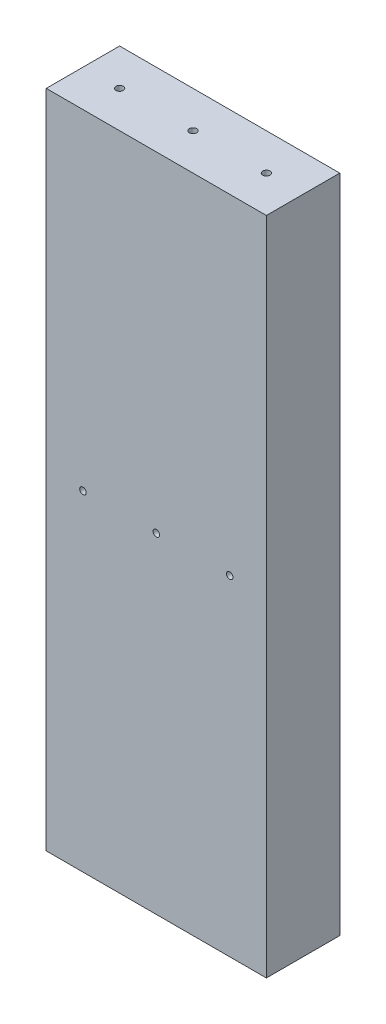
ISO-10303-21;
HEADER;
FILE_DESCRIPTION(('STEP AP214'),'2;1');
FILE_NAME('part.step','',(''),(''),'','','');
FILE_SCHEMA(('AUTOMOTIVE_DESIGN { 1 0 10303 214 1 1 1 1 }'));
ENDSEC;
DATA;
#1=APPLICATION_CONTEXT('core data for automotive mechanical design processes');
#2=APPLICATION_PROTOCOL_DEFINITION('international standard','automotive_design',2000,#1);
#3=PRODUCT_CONTEXT('',#1,'mechanical');
#4=PRODUCT('Part','Part','',(#3));
#5=PRODUCT_RELATED_PRODUCT_CATEGORY('part','',(#4));
#6=PRODUCT_DEFINITION_FORMATION('','',#4);
#7=PRODUCT_DEFINITION_CONTEXT('part definition',#1,'design');
#8=PRODUCT_DEFINITION('design','',#6,#7);
#9=PRODUCT_DEFINITION_SHAPE('','',#8);
#10=(LENGTH_UNIT() NAMED_UNIT(*) SI_UNIT(.MILLI.,.METRE.));
#11=(NAMED_UNIT(*) PLANE_ANGLE_UNIT() SI_UNIT($,.RADIAN.));
#12=(NAMED_UNIT(*) SI_UNIT($,.STERADIAN.) SOLID_ANGLE_UNIT());
#13=UNCERTAINTY_MEASURE_WITH_UNIT(LENGTH_MEASURE(1.E-05),#10,'distance_accuracy_value','');
#14=(GEOMETRIC_REPRESENTATION_CONTEXT(3) GLOBAL_UNCERTAINTY_ASSIGNED_CONTEXT((#13)) GLOBAL_UNIT_ASSIGNED_CONTEXT((#10,
#11,#12)) REPRESENTATION_CONTEXT('',''));
#15=CARTESIAN_POINT('',(0.,0.,0.));
#16=DIRECTION('',(0.,0.,1.));
#17=DIRECTION('',(1.,0.,0.));
#18=AXIS2_PLACEMENT_3D('',#15,#16,#17);
#19=CARTESIAN_POINT('',(76.2,457.2,-25.4));
#20=DIRECTION('',(-1.,0.,0.));
#21=DIRECTION('',(0.,0.,1.));
#22=AXIS2_PLACEMENT_3D('',#19,#20,#21);
#23=PLANE('',#22);
#24=DIRECTION('',(0.,0.,-1.));
#25=VECTOR('',#24,1.);
#26=CARTESIAN_POINT('',(76.2,0.,-25.4));
#27=LINE('',#26,#25);
#28=CARTESIAN_POINT('',(76.2,0.,25.4));
#29=VERTEX_POINT('',#28);
#30=CARTESIAN_POINT('',(76.2,0.,-25.4));
#31=VERTEX_POINT('',#30);
#32=EDGE_CURVE('E170',#29,#31,#27,.T.);
#33=ORIENTED_EDGE('',*,*,#32,.T.);
#34=DIRECTION('',(0.,-1.,0.));
#35=VECTOR('',#34,1.);
#36=CARTESIAN_POINT('',(76.2,457.2,-25.4));
#37=LINE('',#36,#35);
#38=CARTESIAN_POINT('',(76.2,457.2,-25.4));
#39=VERTEX_POINT('',#38);
#40=EDGE_CURVE('E11',#39,#31,#37,.T.);
#41=ORIENTED_EDGE('',*,*,#40,.F.);
#42=DIRECTION('',(0.,0.,-1.));
#43=VECTOR('',#42,1.);
#44=CARTESIAN_POINT('',(76.2,457.2,-25.4));
#45=LINE('',#44,#43);
#46=CARTESIAN_POINT('',(76.2,457.2,25.4));
#47=VERTEX_POINT('',#46);
#48=EDGE_CURVE('E171',#47,#39,#45,.T.);
#49=ORIENTED_EDGE('',*,*,#48,.F.);
#50=DIRECTION('',(0.,-1.,0.));
#51=VECTOR('',#50,1.);
#52=CARTESIAN_POINT('',(76.2,457.2,25.4));
#53=LINE('',#52,#51);
#54=EDGE_CURVE('E177',#47,#29,#53,.T.);
#55=ORIENTED_EDGE('',*,*,#54,.T.);
#56=EDGE_LOOP('',(#33,#41,#49,#55));
#57=FACE_BOUND('',#56,.T.);
#58=ADVANCED_FACE('F32',(#57),#23,.F.);
#59=CARTESIAN_POINT('',(-76.2,457.2,-25.4));
#60=DIRECTION('',(0.,0.,1.));
#61=DIRECTION('',(1.,0.,0.));
#62=AXIS2_PLACEMENT_3D('',#59,#60,#61);
#63=PLANE('',#62);
#64=CARTESIAN_POINT('',(-50.8,228.6,-25.4));
#65=DIRECTION('',(0.,0.,-1.));
#66=DIRECTION('',(-1.,0.,0.));
#67=AXIS2_PLACEMENT_3D('',#64,#65,#66);
#68=CIRCLE('',#67,4.2164);
#69=CARTESIAN_POINT('',(-55.0164,228.6,-25.4));
#70=VERTEX_POINT('',#69);
#71=EDGE_CURVE('E143',#70,#70,#68,.T.);
#72=ORIENTED_EDGE('',*,*,#71,.F.);
#73=EDGE_LOOP('',(#72));
#74=FACE_BOUND('',#73,.T.);
#75=CARTESIAN_POINT('',(0.,228.6,-25.4));
#76=DIRECTION('',(0.,0.,-1.));
#77=DIRECTION('',(-1.,0.,0.));
#78=AXIS2_PLACEMENT_3D('',#75,#76,#77);
#79=CIRCLE('',#78,4.2164);
#80=CARTESIAN_POINT('',(-4.2164,228.6,-25.4));
#81=VERTEX_POINT('',#80);
#82=EDGE_CURVE('E152',#81,#81,#79,.T.);
#83=ORIENTED_EDGE('',*,*,#82,.F.);
#84=EDGE_LOOP('',(#83));
#85=FACE_BOUND('',#84,.T.);
#86=CARTESIAN_POINT('',(50.8,228.6,-25.4));
#87=DIRECTION('',(0.,0.,-1.));
#88=DIRECTION('',(-1.,0.,0.));
#89=AXIS2_PLACEMENT_3D('',#86,#87,#88);
#90=CIRCLE('',#89,4.2164);
#91=CARTESIAN_POINT('',(46.5836,228.6,-25.4));
#92=VERTEX_POINT('',#91);
#93=EDGE_CURVE('E161',#92,#92,#90,.T.);
#94=ORIENTED_EDGE('',*,*,#93,.F.);
#95=EDGE_LOOP('',(#94));
#96=FACE_BOUND('',#95,.T.);
#97=DIRECTION('',(-1.,0.,0.));
#98=VECTOR('',#97,1.);
#99=CARTESIAN_POINT('',(-76.2,0.,-25.4));
#100=LINE('',#99,#98);
#101=CARTESIAN_POINT('',(-76.2,0.,-25.4));
#102=VERTEX_POINT('',#101);
#103=EDGE_CURVE('E180',#31,#102,#100,.T.);
#104=ORIENTED_EDGE('',*,*,#103,.T.);
#105=DIRECTION('',(0.,-1.,0.));
#106=VECTOR('',#105,1.);
#107=CARTESIAN_POINT('',(-76.2,457.2,-25.4));
#108=LINE('',#107,#106);
#109=CARTESIAN_POINT('',(-76.2,457.2,-25.4));
#110=VERTEX_POINT('',#109);
#111=EDGE_CURVE('E40',#110,#102,#108,.T.);
#112=ORIENTED_EDGE('',*,*,#111,.F.);
#113=DIRECTION('',(-1.,0.,0.));
#114=VECTOR('',#113,1.);
#115=CARTESIAN_POINT('',(-76.2,457.2,-25.4));
#116=LINE('',#115,#114);
#117=EDGE_CURVE('E79',#39,#110,#116,.T.);
#118=ORIENTED_EDGE('',*,*,#117,.F.);
#119=ORIENTED_EDGE('',*,*,#40,.T.);
#120=EDGE_LOOP('',(#104,#112,#118,#119));
#121=FACE_BOUND('',#120,.T.);
#122=ADVANCED_FACE('F205',(#74,#85,#96,#121),#63,.F.);
#123=CARTESIAN_POINT('',(-76.2,457.2,-25.4));
#124=DIRECTION('',(1.,0.,0.));
#125=DIRECTION('',(0.,0.,-1.));
#126=AXIS2_PLACEMENT_3D('',#123,#124,#125);
#127=PLANE('',#126);
#128=DIRECTION('',(0.,0.,1.));
#129=VECTOR('',#128,1.);
#130=CARTESIAN_POINT('',(-76.2,0.,-25.4));
#131=LINE('',#130,#129);
#132=CARTESIAN_POINT('',(-76.2,0.,25.4));
#133=VERTEX_POINT('',#132);
#134=EDGE_CURVE('E66',#102,#133,#131,.T.);
#135=ORIENTED_EDGE('',*,*,#134,.T.);
#136=DIRECTION('',(0.,-1.,0.));
#137=VECTOR('',#136,1.);
#138=CARTESIAN_POINT('',(-76.2,457.2,25.4));
#139=LINE('',#138,#137);
#140=CARTESIAN_POINT('',(-76.2,457.2,25.4));
#141=VERTEX_POINT('',#140);
#142=EDGE_CURVE('E185',#141,#133,#139,.T.);
#143=ORIENTED_EDGE('',*,*,#142,.F.);
#144=DIRECTION('',(0.,0.,1.));
#145=VECTOR('',#144,1.);
#146=CARTESIAN_POINT('',(-76.2,457.2,-25.4));
#147=LINE('',#146,#145);
#148=EDGE_CURVE('E174',#110,#141,#147,.T.);
#149=ORIENTED_EDGE('',*,*,#148,.F.);
#150=ORIENTED_EDGE('',*,*,#111,.T.);
#151=EDGE_LOOP('',(#135,#143,#149,#150));
#152=FACE_BOUND('',#151,.T.);
#153=ADVANCED_FACE('F187',(#152),#127,.F.);
#154=CARTESIAN_POINT('',(-76.2,457.2,25.4));
#155=DIRECTION('',(0.,0.,-1.));
#156=DIRECTION('',(-1.,0.,0.));
#157=AXIS2_PLACEMENT_3D('',#154,#155,#156);
#158=PLANE('',#157);
#159=CARTESIAN_POINT('',(-50.8,228.6,25.4));
#160=DIRECTION('',(0.,0.,-1.));
#161=DIRECTION('',(-1.,0.,0.));
#162=AXIS2_PLACEMENT_3D('',#159,#160,#161);
#163=CIRCLE('',#162,2.24789999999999);
#164=CARTESIAN_POINT('',(-53.0479,228.6,25.4));
#165=VERTEX_POINT('',#164);
#166=EDGE_CURVE('E149',#165,#165,#163,.T.);
#167=ORIENTED_EDGE('',*,*,#166,.T.);
#168=EDGE_LOOP('',(#167));
#169=FACE_BOUND('',#168,.T.);
#170=CARTESIAN_POINT('',(0.,228.6,25.4));
#171=DIRECTION('',(0.,0.,-1.));
#172=DIRECTION('',(-1.,0.,0.));
#173=AXIS2_PLACEMENT_3D('',#170,#171,#172);
#174=CIRCLE('',#173,2.24789999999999);
#175=CARTESIAN_POINT('',(-2.24789999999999,228.6,25.4));
#176=VERTEX_POINT('',#175);
#177=EDGE_CURVE('E158',#176,#176,#174,.T.);
#178=ORIENTED_EDGE('',*,*,#177,.T.);
#179=EDGE_LOOP('',(#178));
#180=FACE_BOUND('',#179,.T.);
#181=CARTESIAN_POINT('',(50.8,228.6,25.4));
#182=DIRECTION('',(0.,0.,-1.));
#183=DIRECTION('',(-1.,0.,0.));
#184=AXIS2_PLACEMENT_3D('',#181,#182,#183);
#185=CIRCLE('',#184,2.24789999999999);
#186=CARTESIAN_POINT('',(48.5521,228.6,25.4));
#187=VERTEX_POINT('',#186);
#188=EDGE_CURVE('E167',#187,#187,#185,.T.);
#189=ORIENTED_EDGE('',*,*,#188,.T.);
#190=EDGE_LOOP('',(#189));
#191=FACE_BOUND('',#190,.T.);
#192=DIRECTION('',(1.,0.,0.));
#193=VECTOR('',#192,1.);
#194=CARTESIAN_POINT('',(-76.2,0.,25.4));
#195=LINE('',#194,#193);
#196=EDGE_CURVE('E72',#133,#29,#195,.T.);
#197=ORIENTED_EDGE('',*,*,#196,.T.);
#198=ORIENTED_EDGE('',*,*,#54,.F.);
#199=DIRECTION('',(1.,0.,0.));
#200=VECTOR('',#199,1.);
#201=CARTESIAN_POINT('',(-76.2,457.2,25.4));
#202=LINE('',#201,#200);
#203=EDGE_CURVE('E48',#141,#47,#202,.T.);
#204=ORIENTED_EDGE('',*,*,#203,.F.);
#205=ORIENTED_EDGE('',*,*,#142,.T.);
#206=EDGE_LOOP('',(#197,#198,#204,#205));
#207=FACE_BOUND('',#206,.T.);
#208=ADVANCED_FACE('F194',(#169,#180,#191,#207),#158,.F.);
#209=CARTESIAN_POINT('',(0.,457.2,0.));
#210=DIRECTION('',(0.,1.,0.));
#211=DIRECTION('',(0.,0.,1.));
#212=AXIS2_PLACEMENT_3D('',#209,#210,#211);
#213=PLANE('',#212);
#214=CARTESIAN_POINT('',(-50.8000000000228,457.2,8.21565038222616E-12));
#215=DIRECTION('',(0.,1.,0.));
#216=DIRECTION('',(0.,0.,1.));
#217=AXIS2_PLACEMENT_3D('',#214,#215,#216);
#218=CIRCLE('',#217,2.52729999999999);
#219=CARTESIAN_POINT('',(-50.8000000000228,457.2,2.5273000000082));
#220=VERTEX_POINT('',#219);
#221=EDGE_CURVE('E109',#220,#220,#218,.T.);
#222=ORIENTED_EDGE('',*,*,#221,.F.);
#223=EDGE_LOOP('',(#222));
#224=FACE_BOUND('',#223,.T.);
#225=CARTESIAN_POINT('',(0.,457.2,0.));
#226=DIRECTION('',(0.,1.,0.));
#227=DIRECTION('',(0.,0.,1.));
#228=AXIS2_PLACEMENT_3D('',#225,#226,#227);
#229=CIRCLE('',#228,2.52729999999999);
#230=CARTESIAN_POINT('',(0.,457.2,2.52729999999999));
#231=VERTEX_POINT('',#230);
#232=EDGE_CURVE('E108',#231,#231,#229,.T.);
#233=ORIENTED_EDGE('',*,*,#232,.F.);
#234=EDGE_LOOP('',(#233));
#235=FACE_BOUND('',#234,.T.);
#236=CARTESIAN_POINT('',(50.7999999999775,457.2,8.27116153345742E-12));
#237=DIRECTION('',(0.,1.,0.));
#238=DIRECTION('',(0.,0.,1.));
#239=AXIS2_PLACEMENT_3D('',#236,#237,#238);
#240=CIRCLE('',#239,2.52729999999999);
#241=CARTESIAN_POINT('',(50.7999999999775,457.2,2.52730000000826));
#242=VERTEX_POINT('',#241);
#243=EDGE_CURVE('E119',#242,#242,#240,.T.);
#244=ORIENTED_EDGE('',*,*,#243,.F.);
#245=EDGE_LOOP('',(#244));
#246=FACE_BOUND('',#245,.T.);
#247=ORIENTED_EDGE('',*,*,#48,.T.);
#248=ORIENTED_EDGE('',*,*,#117,.T.);
#249=ORIENTED_EDGE('',*,*,#148,.T.);
#250=ORIENTED_EDGE('',*,*,#203,.T.);
#251=EDGE_LOOP('',(#247,#248,#249,#250));
#252=FACE_BOUND('',#251,.T.);
#253=ADVANCED_FACE('F196',(#224,#235,#246,#252),#213,.T.);
#254=CARTESIAN_POINT('',(0.,0.,0.));
#255=DIRECTION('',(0.,1.,0.));
#256=DIRECTION('',(0.,0.,1.));
#257=AXIS2_PLACEMENT_3D('',#254,#255,#256);
#258=PLANE('',#257);
#259=CARTESIAN_POINT('',(50.7999999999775,0.,8.27116153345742E-12));
#260=DIRECTION('',(0.,-1.,0.));
#261=DIRECTION('',(0.,0.,-1.));
#262=AXIS2_PLACEMENT_3D('',#259,#260,#261);
#263=CIRCLE('',#262,2.52729999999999);
#264=CARTESIAN_POINT('',(50.7999999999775,0.,-2.52729999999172));
#265=VERTEX_POINT('',#264);
#266=EDGE_CURVE('E125',#265,#265,#263,.T.);
#267=ORIENTED_EDGE('',*,*,#266,.F.);
#268=EDGE_LOOP('',(#267));
#269=FACE_BOUND('',#268,.T.);
#270=CARTESIAN_POINT('',(0.,0.,0.));
#271=DIRECTION('',(0.,-1.,0.));
#272=DIRECTION('',(0.,0.,-1.));
#273=AXIS2_PLACEMENT_3D('',#270,#271,#272);
#274=CIRCLE('',#273,2.52729999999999);
#275=CARTESIAN_POINT('',(0.,0.,-2.52729999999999));
#276=VERTEX_POINT('',#275);
#277=EDGE_CURVE('E131',#276,#276,#274,.T.);
#278=ORIENTED_EDGE('',*,*,#277,.F.);
#279=EDGE_LOOP('',(#278));
#280=FACE_BOUND('',#279,.T.);
#281=CARTESIAN_POINT('',(-50.8000000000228,0.,8.21565038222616E-12));
#282=DIRECTION('',(0.,-1.,0.));
#283=DIRECTION('',(0.,0.,-1.));
#284=AXIS2_PLACEMENT_3D('',#281,#282,#283);
#285=CIRCLE('',#284,2.52729999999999);
#286=CARTESIAN_POINT('',(-50.8000000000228,0.,-2.52729999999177));
#287=VERTEX_POINT('',#286);
#288=EDGE_CURVE('E137',#287,#287,#285,.T.);
#289=ORIENTED_EDGE('',*,*,#288,.F.);
#290=EDGE_LOOP('',(#289));
#291=FACE_BOUND('',#290,.T.);
#292=ORIENTED_EDGE('',*,*,#32,.F.);
#293=ORIENTED_EDGE('',*,*,#196,.F.);
#294=ORIENTED_EDGE('',*,*,#134,.F.);
#295=ORIENTED_EDGE('',*,*,#103,.F.);
#296=EDGE_LOOP('',(#292,#293,#294,#295));
#297=FACE_BOUND('',#296,.T.);
#298=ADVANCED_FACE('F190',(#269,#280,#291,#297),#258,.F.);
#299=CARTESIAN_POINT('',(50.8,228.6,-25.4));
#300=DIRECTION('',(0.,0.,-1.));
#301=DIRECTION('',(-1.,0.,0.));
#302=AXIS2_PLACEMENT_3D('',#299,#300,#301);
#303=CYLINDRICAL_SURFACE('',#302,2.24789999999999);
#304=ORIENTED_EDGE('',*,*,#188,.F.);
#305=EDGE_LOOP('',(#304));
#306=FACE_BOUND('',#305,.T.);
#307=CARTESIAN_POINT('',(50.8,228.6,-23.7482323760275));
#308=DIRECTION('',(0.,0.,-1.));
#309=DIRECTION('',(-1.,0.,0.));
#310=AXIS2_PLACEMENT_3D('',#307,#308,#309);
#311=CIRCLE('',#310,2.24789999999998);
#312=CARTESIAN_POINT('',(48.5521,228.6,-23.7482323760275));
#313=VERTEX_POINT('',#312);
#314=EDGE_CURVE('E164',#313,#313,#311,.T.);
#315=ORIENTED_EDGE('',*,*,#314,.T.);
#316=EDGE_LOOP('',(#315));
#317=FACE_BOUND('',#316,.T.);
#318=ADVANCED_FACE('F225',(#306,#317),#303,.F.);
#319=CARTESIAN_POINT('',(50.8,228.6,-25.4));
#320=DIRECTION('',(0.,0.,-1.));
#321=DIRECTION('',(-1.,0.,0.));
#322=AXIS2_PLACEMENT_3D('',#319,#320,#321);
#323=CONICAL_SURFACE('',#322,4.2164,0.87266462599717);
#324=ORIENTED_EDGE('',*,*,#314,.F.);
#325=EDGE_LOOP('',(#324));
#326=FACE_BOUND('',#325,.T.);
#327=ORIENTED_EDGE('',*,*,#93,.T.);
#328=EDGE_LOOP('',(#327));
#329=FACE_BOUND('',#328,.T.);
#330=ADVANCED_FACE('F222',(#326,#329),#323,.F.);
#331=CARTESIAN_POINT('',(0.,228.6,-25.4));
#332=DIRECTION('',(0.,0.,-1.));
#333=DIRECTION('',(-1.,0.,0.));
#334=AXIS2_PLACEMENT_3D('',#331,#332,#333);
#335=CYLINDRICAL_SURFACE('',#334,2.24789999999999);
#336=ORIENTED_EDGE('',*,*,#177,.F.);
#337=EDGE_LOOP('',(#336));
#338=FACE_BOUND('',#337,.T.);
#339=CARTESIAN_POINT('',(0.,228.6,-23.7482323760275));
#340=DIRECTION('',(0.,0.,-1.));
#341=DIRECTION('',(-1.,0.,0.));
#342=AXIS2_PLACEMENT_3D('',#339,#340,#341);
#343=CIRCLE('',#342,2.24789999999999);
#344=CARTESIAN_POINT('',(-2.24789999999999,228.6,-23.7482323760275));
#345=VERTEX_POINT('',#344);
#346=EDGE_CURVE('E155',#345,#345,#343,.T.);
#347=ORIENTED_EDGE('',*,*,#346,.T.);
#348=EDGE_LOOP('',(#347));
#349=FACE_BOUND('',#348,.T.);
#350=ADVANCED_FACE('F224',(#338,#349),#335,.F.);
#351=CARTESIAN_POINT('',(0.,228.6,-25.4));
#352=DIRECTION('',(0.,0.,-1.));
#353=DIRECTION('',(-1.,0.,0.));
#354=AXIS2_PLACEMENT_3D('',#351,#352,#353);
#355=CONICAL_SURFACE('',#354,4.2164,0.872664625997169);
#356=ORIENTED_EDGE('',*,*,#346,.F.);
#357=EDGE_LOOP('',(#356));
#358=FACE_BOUND('',#357,.T.);
#359=ORIENTED_EDGE('',*,*,#82,.T.);
#360=EDGE_LOOP('',(#359));
#361=FACE_BOUND('',#360,.T.);
#362=ADVANCED_FACE('F232',(#358,#361),#355,.F.);
#363=CARTESIAN_POINT('',(-50.8,228.6,-25.4));
#364=DIRECTION('',(0.,0.,-1.));
#365=DIRECTION('',(-1.,0.,0.));
#366=AXIS2_PLACEMENT_3D('',#363,#364,#365);
#367=CYLINDRICAL_SURFACE('',#366,2.24789999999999);
#368=ORIENTED_EDGE('',*,*,#166,.F.);
#369=EDGE_LOOP('',(#368));
#370=FACE_BOUND('',#369,.T.);
#371=CARTESIAN_POINT('',(-50.8,228.6,-23.7482323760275));
#372=DIRECTION('',(0.,0.,-1.));
#373=DIRECTION('',(-1.,0.,0.));
#374=AXIS2_PLACEMENT_3D('',#371,#372,#373);
#375=CIRCLE('',#374,2.24789999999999);
#376=CARTESIAN_POINT('',(-53.0479,228.6,-23.7482323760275));
#377=VERTEX_POINT('',#376);
#378=EDGE_CURVE('E146',#377,#377,#375,.T.);
#379=ORIENTED_EDGE('',*,*,#378,.T.);
#380=EDGE_LOOP('',(#379));
#381=FACE_BOUND('',#380,.T.);
#382=ADVANCED_FACE('F270',(#370,#381),#367,.F.);
#383=CARTESIAN_POINT('',(-50.8,228.6,-25.4));
#384=DIRECTION('',(0.,0.,-1.));
#385=DIRECTION('',(-1.,0.,0.));
#386=AXIS2_PLACEMENT_3D('',#383,#384,#385);
#387=CONICAL_SURFACE('',#386,4.2164,0.872664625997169);
#388=ORIENTED_EDGE('',*,*,#378,.F.);
#389=EDGE_LOOP('',(#388));
#390=FACE_BOUND('',#389,.T.);
#391=ORIENTED_EDGE('',*,*,#71,.T.);
#392=EDGE_LOOP('',(#391));
#393=FACE_BOUND('',#392,.T.);
#394=ADVANCED_FACE('F262',(#390,#393),#387,.F.);
#395=CARTESIAN_POINT('',(-50.8000000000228,25.4,8.21565038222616E-12));
#396=DIRECTION('',(0.,-1.,0.));
#397=DIRECTION('',(0.,0.,-1.));
#398=AXIS2_PLACEMENT_3D('',#395,#396,#397);
#399=CONICAL_SURFACE('',#398,2.52729999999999,1.02974425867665);
#400=CARTESIAN_POINT('',(-50.8000000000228,26.9185550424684,8.21565038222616E-12));
#401=VERTEX_POINT('',#400);
#402=VERTEX_LOOP('',#401);
#403=FACE_BOUND('',#402,.T.);
#404=CARTESIAN_POINT('',(-50.8000000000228,25.4,8.21565038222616E-12));
#405=DIRECTION('',(0.,-1.,0.));
#406=DIRECTION('',(0.,0.,-1.));
#407=AXIS2_PLACEMENT_3D('',#404,#405,#406);
#408=CIRCLE('',#407,2.52729999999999);
#409=CARTESIAN_POINT('',(-50.8000000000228,25.4,-2.52729999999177));
#410=VERTEX_POINT('',#409);
#411=EDGE_CURVE('E140',#410,#410,#408,.T.);
#412=ORIENTED_EDGE('',*,*,#411,.T.);
#413=EDGE_LOOP('',(#412));
#414=FACE_BOUND('',#413,.T.);
#415=ADVANCED_FACE('F252',(#403,#414),#399,.F.);
#416=CARTESIAN_POINT('',(-50.8000000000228,0.,8.21565038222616E-12));
#417=DIRECTION('',(0.,-1.,0.));
#418=DIRECTION('',(0.,0.,-1.));
#419=AXIS2_PLACEMENT_3D('',#416,#417,#418);
#420=CYLINDRICAL_SURFACE('',#419,2.52729999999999);
#421=ORIENTED_EDGE('',*,*,#411,.F.);
#422=EDGE_LOOP('',(#421));
#423=FACE_BOUND('',#422,.T.);
#424=ORIENTED_EDGE('',*,*,#288,.T.);
#425=EDGE_LOOP('',(#424));
#426=FACE_BOUND('',#425,.T.);
#427=ADVANCED_FACE('F249',(#423,#426),#420,.F.);
#428=CARTESIAN_POINT('',(0.,25.4,0.));
#429=DIRECTION('',(0.,-1.,0.));
#430=DIRECTION('',(0.,0.,-1.));
#431=AXIS2_PLACEMENT_3D('',#428,#429,#430);
#432=CONICAL_SURFACE('',#431,2.52729999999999,1.02974425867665);
#433=CARTESIAN_POINT('',(0.,26.9185550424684,0.));
#434=VERTEX_POINT('',#433);
#435=VERTEX_LOOP('',#434);
#436=FACE_BOUND('',#435,.T.);
#437=CARTESIAN_POINT('',(0.,25.4,0.));
#438=DIRECTION('',(0.,-1.,0.));
#439=DIRECTION('',(0.,0.,-1.));
#440=AXIS2_PLACEMENT_3D('',#437,#438,#439);
#441=CIRCLE('',#440,2.52729999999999);
#442=CARTESIAN_POINT('',(0.,25.4,-2.52729999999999));
#443=VERTEX_POINT('',#442);
#444=EDGE_CURVE('E134',#443,#443,#441,.T.);
#445=ORIENTED_EDGE('',*,*,#444,.T.);
#446=EDGE_LOOP('',(#445));
#447=FACE_BOUND('',#446,.T.);
#448=ADVANCED_FACE('F251',(#436,#447),#432,.F.);
#449=CARTESIAN_POINT('',(0.,0.,0.));
#450=DIRECTION('',(0.,-1.,0.));
#451=DIRECTION('',(0.,0.,-1.));
#452=AXIS2_PLACEMENT_3D('',#449,#450,#451);
#453=CYLINDRICAL_SURFACE('',#452,2.52729999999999);
#454=ORIENTED_EDGE('',*,*,#444,.F.);
#455=EDGE_LOOP('',(#454));
#456=FACE_BOUND('',#455,.T.);
#457=ORIENTED_EDGE('',*,*,#277,.T.);
#458=EDGE_LOOP('',(#457));
#459=FACE_BOUND('',#458,.T.);
#460=ADVANCED_FACE('F259',(#456,#459),#453,.F.);
#461=CARTESIAN_POINT('',(50.7999999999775,25.4,8.27116153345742E-12));
#462=DIRECTION('',(0.,-1.,0.));
#463=DIRECTION('',(0.,0.,-1.));
#464=AXIS2_PLACEMENT_3D('',#461,#462,#463);
#465=CONICAL_SURFACE('',#464,2.52729999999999,1.02974425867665);
#466=CARTESIAN_POINT('',(50.7999999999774,26.9185550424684,8.27116153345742E-12));
#467=VERTEX_POINT('',#466);
#468=VERTEX_LOOP('',#467);
#469=FACE_BOUND('',#468,.T.);
#470=CARTESIAN_POINT('',(50.7999999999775,25.4,8.27116153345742E-12));
#471=DIRECTION('',(0.,-1.,0.));
#472=DIRECTION('',(0.,0.,-1.));
#473=AXIS2_PLACEMENT_3D('',#470,#471,#472);
#474=CIRCLE('',#473,2.52729999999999);
#475=CARTESIAN_POINT('',(50.7999999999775,25.4,-2.52729999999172));
#476=VERTEX_POINT('',#475);
#477=EDGE_CURVE('E128',#476,#476,#474,.T.);
#478=ORIENTED_EDGE('',*,*,#477,.T.);
#479=EDGE_LOOP('',(#478));
#480=FACE_BOUND('',#479,.T.);
#481=ADVANCED_FACE('F316',(#469,#480),#465,.F.);
#482=CARTESIAN_POINT('',(50.7999999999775,0.,8.27116153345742E-12));
#483=DIRECTION('',(0.,-1.,0.));
#484=DIRECTION('',(0.,0.,-1.));
#485=AXIS2_PLACEMENT_3D('',#482,#483,#484);
#486=CYLINDRICAL_SURFACE('',#485,2.52729999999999);
#487=ORIENTED_EDGE('',*,*,#477,.F.);
#488=EDGE_LOOP('',(#487));
#489=FACE_BOUND('',#488,.T.);
#490=ORIENTED_EDGE('',*,*,#266,.T.);
#491=EDGE_LOOP('',(#490));
#492=FACE_BOUND('',#491,.T.);
#493=ADVANCED_FACE('F325',(#489,#492),#486,.F.);
#494=CARTESIAN_POINT('',(50.7999999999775,431.8,8.27116153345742E-12));
#495=DIRECTION('',(0.,1.,0.));
#496=DIRECTION('',(0.,0.,1.));
#497=AXIS2_PLACEMENT_3D('',#494,#495,#496);
#498=CONICAL_SURFACE('',#497,2.52729999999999,1.02974425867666);
#499=CARTESIAN_POINT('',(50.7999999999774,430.281444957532,8.27116153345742E-12));
#500=VERTEX_POINT('',#499);
#501=VERTEX_LOOP('',#500);
#502=FACE_BOUND('',#501,.T.);
#503=CARTESIAN_POINT('',(50.7999999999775,431.8,8.27116153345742E-12));
#504=DIRECTION('',(0.,1.,0.));
#505=DIRECTION('',(0.,0.,1.));
#506=AXIS2_PLACEMENT_3D('',#503,#504,#505);
#507=CIRCLE('',#506,2.52729999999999);
#508=CARTESIAN_POINT('',(50.7999999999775,431.8,2.52730000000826));
#509=VERTEX_POINT('',#508);
#510=EDGE_CURVE('E122',#509,#509,#507,.T.);
#511=ORIENTED_EDGE('',*,*,#510,.T.);
#512=EDGE_LOOP('',(#511));
#513=FACE_BOUND('',#512,.T.);
#514=ADVANCED_FACE('F335',(#502,#513),#498,.F.);
#515=CARTESIAN_POINT('',(50.7999999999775,457.2,8.27116153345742E-12));
#516=DIRECTION('',(0.,1.,0.));
#517=DIRECTION('',(0.,0.,1.));
#518=AXIS2_PLACEMENT_3D('',#515,#516,#517);
#519=CYLINDRICAL_SURFACE('',#518,2.52729999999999);
#520=ORIENTED_EDGE('',*,*,#510,.F.);
#521=EDGE_LOOP('',(#520));
#522=FACE_BOUND('',#521,.T.);
#523=ORIENTED_EDGE('',*,*,#243,.T.);
#524=EDGE_LOOP('',(#523));
#525=FACE_BOUND('',#524,.T.);
#526=ADVANCED_FACE('F352',(#522,#525),#519,.F.);
#527=CARTESIAN_POINT('',(0.,431.8,0.));
#528=DIRECTION('',(0.,1.,0.));
#529=DIRECTION('',(0.,0.,1.));
#530=AXIS2_PLACEMENT_3D('',#527,#528,#529);
#531=CONICAL_SURFACE('',#530,2.52729999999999,1.02974425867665);
#532=CARTESIAN_POINT('',(0.,430.281444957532,0.));
#533=VERTEX_POINT('',#532);
#534=VERTEX_LOOP('',#533);
#535=FACE_BOUND('',#534,.T.);
#536=CARTESIAN_POINT('',(0.,431.8,0.));
#537=DIRECTION('',(0.,1.,0.));
#538=DIRECTION('',(0.,0.,1.));
#539=AXIS2_PLACEMENT_3D('',#536,#537,#538);
#540=CIRCLE('',#539,2.52729999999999);
#541=CARTESIAN_POINT('',(0.,431.8,2.52729999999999));
#542=VERTEX_POINT('',#541);
#543=EDGE_CURVE('E112',#542,#542,#540,.T.);
#544=ORIENTED_EDGE('',*,*,#543,.T.);
#545=EDGE_LOOP('',(#544));
#546=FACE_BOUND('',#545,.T.);
#547=ADVANCED_FACE('F362',(#535,#546),#531,.F.);
#548=CARTESIAN_POINT('',(0.,457.2,0.));
#549=DIRECTION('',(0.,1.,0.));
#550=DIRECTION('',(0.,0.,1.));
#551=AXIS2_PLACEMENT_3D('',#548,#549,#550);
#552=CYLINDRICAL_SURFACE('',#551,2.52729999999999);
#553=ORIENTED_EDGE('',*,*,#543,.F.);
#554=EDGE_LOOP('',(#553));
#555=FACE_BOUND('',#554,.T.);
#556=ORIENTED_EDGE('',*,*,#232,.T.);
#557=EDGE_LOOP('',(#556));
#558=FACE_BOUND('',#557,.T.);
#559=ADVANCED_FACE('F102',(#555,#558),#552,.F.);
#560=CARTESIAN_POINT('',(-50.8000000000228,431.8,8.21565038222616E-12));
#561=DIRECTION('',(0.,1.,0.));
#562=DIRECTION('',(0.,0.,1.));
#563=AXIS2_PLACEMENT_3D('',#560,#561,#562);
#564=CONICAL_SURFACE('',#563,2.52729999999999,1.02974425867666);
#565=CARTESIAN_POINT('',(-50.8000000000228,430.281444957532,8.21565038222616E-12));
#566=VERTEX_POINT('',#565);
#567=VERTEX_LOOP('',#566);
#568=FACE_BOUND('',#567,.T.);
#569=CARTESIAN_POINT('',(-50.8000000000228,431.8,8.21565038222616E-12));
#570=DIRECTION('',(0.,1.,0.));
#571=DIRECTION('',(0.,0.,1.));
#572=AXIS2_PLACEMENT_3D('',#569,#570,#571);
#573=CIRCLE('',#572,2.52729999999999);
#574=CARTESIAN_POINT('',(-50.8000000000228,431.8,2.5273000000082));
#575=VERTEX_POINT('',#574);
#576=EDGE_CURVE('E106',#575,#575,#573,.T.);
#577=ORIENTED_EDGE('',*,*,#576,.T.);
#578=EDGE_LOOP('',(#577));
#579=FACE_BOUND('',#578,.T.);
#580=ADVANCED_FACE('F98',(#568,#579),#564,.F.);
#581=CARTESIAN_POINT('',(-50.8000000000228,457.2,8.21565038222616E-12));
#582=DIRECTION('',(0.,1.,0.));
#583=DIRECTION('',(0.,0.,1.));
#584=AXIS2_PLACEMENT_3D('',#581,#582,#583);
#585=CYLINDRICAL_SURFACE('',#584,2.52729999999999);
#586=ORIENTED_EDGE('',*,*,#576,.F.);
#587=EDGE_LOOP('',(#586));
#588=FACE_BOUND('',#587,.T.);
#589=ORIENTED_EDGE('',*,*,#221,.T.);
#590=EDGE_LOOP('',(#589));
#591=FACE_BOUND('',#590,.T.);
#592=ADVANCED_FACE('F101',(#588,#591),#585,.F.);
#593=CLOSED_SHELL('',(#58,#122,#153,#208,#253,#298,#318,#330,#350,#362,#382,#394,#415,#427,#448,
#460,#481,#493,#514,#526,#547,#559,#580,#592));
#594=MANIFOLD_SOLID_BREP('B2',#593);
#595=ADVANCED_BREP_SHAPE_REPRESENTATION('',(#18,#594),#14);
#596=SHAPE_DEFINITION_REPRESENTATION(#9,#595);
ENDSEC;
END-ISO-10303-21;
